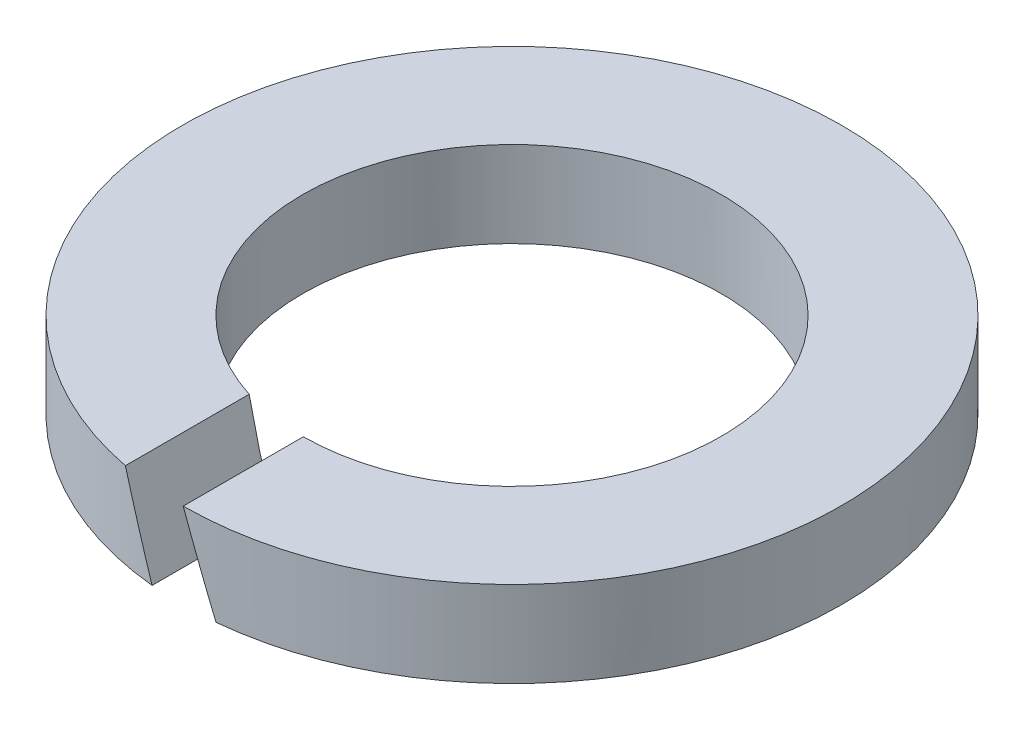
ISO-10303-21;
HEADER;
FILE_DESCRIPTION(('STEP AP214'),'2;1');
FILE_NAME('part.step','',(''),(''),'','','');
FILE_SCHEMA(('AUTOMOTIVE_DESIGN { 1 0 10303 214 1 1 1 1 }'));
ENDSEC;
DATA;
#1=APPLICATION_CONTEXT('core data for automotive mechanical design processes');
#2=APPLICATION_PROTOCOL_DEFINITION('international standard','automotive_design',2000,#1);
#3=PRODUCT_CONTEXT('',#1,'mechanical');
#4=PRODUCT('Part','Part','',(#3));
#5=PRODUCT_RELATED_PRODUCT_CATEGORY('part','',(#4));
#6=PRODUCT_DEFINITION_FORMATION('','',#4);
#7=PRODUCT_DEFINITION_CONTEXT('part definition',#1,'design');
#8=PRODUCT_DEFINITION('design','',#6,#7);
#9=PRODUCT_DEFINITION_SHAPE('','',#8);
#10=(LENGTH_UNIT() NAMED_UNIT(*) SI_UNIT(.MILLI.,.METRE.));
#11=(NAMED_UNIT(*) PLANE_ANGLE_UNIT() SI_UNIT($,.RADIAN.));
#12=(NAMED_UNIT(*) SI_UNIT($,.STERADIAN.) SOLID_ANGLE_UNIT());
#13=UNCERTAINTY_MEASURE_WITH_UNIT(LENGTH_MEASURE(1.E-05),#10,'distance_accuracy_value','');
#14=(GEOMETRIC_REPRESENTATION_CONTEXT(3) GLOBAL_UNCERTAINTY_ASSIGNED_CONTEXT((#13)) GLOBAL_UNIT_ASSIGNED_CONTEXT((#10,
#11,#12)) REPRESENTATION_CONTEXT('',''));
#15=CARTESIAN_POINT('',(0.,0.,0.));
#16=DIRECTION('',(0.,0.,1.));
#17=DIRECTION('',(1.,0.,0.));
#18=AXIS2_PLACEMENT_3D('',#15,#16,#17);
#19=CARTESIAN_POINT('',(0.,15.7596723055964,0.));
#20=DIRECTION('',(0.,1.,0.));
#21=DIRECTION('',(0.,0.,1.));
#22=AXIS2_PLACEMENT_3D('',#19,#20,#21);
#23=CYLINDRICAL_SURFACE('',#22,6.1);
#24=CARTESIAN_POINT('',(0.,0.,0.));
#25=DIRECTION('',(0.,1.,0.));
#26=DIRECTION('',(0.,0.,1.));
#27=AXIS2_PLACEMENT_3D('',#24,#25,#26);
#28=CIRCLE('',#27,6.1);
#29=CARTESIAN_POINT('',(0.931155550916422,0.,6.02851137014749));
#30=VERTEX_POINT('',#29);
#31=CARTESIAN_POINT('',(-0.931155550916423,0.,6.02851137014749));
#32=VERTEX_POINT('',#31);
#33=EDGE_CURVE('E89',#30,#32,#28,.T.);
#34=ORIENTED_EDGE('',*,*,#33,.F.);
#35=CARTESIAN_POINT('',(0.,2.55832885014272,0.));
#36=DIRECTION('',(-0.939692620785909,-0.342020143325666,0.));
#37=DIRECTION('',(-0.342020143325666,0.939692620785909,0.));
#38=AXIS2_PLACEMENT_3D('',#35,#36,#37);
#39=ELLIPSE('',#38,17.8352068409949,6.1);
#40=CARTESIAN_POINT('',(0.0212299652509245,2.5,6.09996305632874));
#41=VERTEX_POINT('',#40);
#42=EDGE_CURVE('E54',#41,#30,#39,.F.);
#43=ORIENTED_EDGE('',*,*,#42,.F.);
#44=CARTESIAN_POINT('',(0.,2.5,0.));
#45=DIRECTION('',(0.,1.,0.));
#46=DIRECTION('',(0.,0.,1.));
#47=AXIS2_PLACEMENT_3D('',#44,#45,#46);
#48=CIRCLE('',#47,6.1);
#49=CARTESIAN_POINT('',(-1.84108113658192,2.5,5.8155326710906));
#50=VERTEX_POINT('',#49);
#51=EDGE_CURVE('E11',#41,#50,#48,.T.);
#52=ORIENTED_EDGE('',*,*,#51,.T.);
#53=CARTESIAN_POINT('',(0.,-2.55832885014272,0.));
#54=DIRECTION('',(0.939692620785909,0.342020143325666,0.));
#55=DIRECTION('',(-0.342020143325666,0.939692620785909,0.));
#56=AXIS2_PLACEMENT_3D('',#53,#54,#55);
#57=ELLIPSE('',#56,17.835206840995,6.1);
#58=EDGE_CURVE('E86',#32,#50,#57,.F.);
#59=ORIENTED_EDGE('',*,*,#58,.F.);
#60=EDGE_LOOP('',(#34,#43,#52,#59));
#61=FACE_BOUND('',#60,.T.);
#62=ADVANCED_FACE('F32',(#61),#23,.F.);
#63=CARTESIAN_POINT('',(-6.1,2.5,0.));
#64=DIRECTION('',(0.,1.,0.));
#65=DIRECTION('',(0.,0.,1.));
#66=AXIS2_PLACEMENT_3D('',#63,#64,#65);
#67=PLANE('',#66);
#68=ORIENTED_EDGE('',*,*,#51,.F.);
#69=DIRECTION('',(0.,0.,-1.));
#70=VECTOR('',#69,1.);
#71=CARTESIAN_POINT('',(0.0212299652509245,2.5,9.601));
#72=LINE('',#71,#70);
#73=CARTESIAN_POINT('',(0.0212299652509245,2.5,9.59997652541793));
#74=VERTEX_POINT('',#73);
#75=EDGE_CURVE('E91',#74,#41,#72,.T.);
#76=ORIENTED_EDGE('',*,*,#75,.F.);
#77=CARTESIAN_POINT('',(0.,2.5,0.));
#78=DIRECTION('',(0.,1.,0.));
#79=DIRECTION('',(0.,0.,1.));
#80=AXIS2_PLACEMENT_3D('',#77,#78,#79);
#81=CIRCLE('',#80,9.6);
#82=CARTESIAN_POINT('',(-1.84108113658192,2.5,9.42180557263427));
#83=VERTEX_POINT('',#82);
#84=EDGE_CURVE('E39',#74,#83,#81,.T.);
#85=ORIENTED_EDGE('',*,*,#84,.T.);
#86=DIRECTION('',(0.,0.,-1.));
#87=VECTOR('',#86,1.);
#88=CARTESIAN_POINT('',(-1.84108113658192,2.5,9.601));
#89=LINE('',#88,#87);
#90=EDGE_CURVE('E95',#83,#50,#89,.T.);
#91=ORIENTED_EDGE('',*,*,#90,.T.);
#92=EDGE_LOOP('',(#68,#76,#85,#91));
#93=FACE_BOUND('',#92,.T.);
#94=ADVANCED_FACE('F106',(#93),#67,.T.);
#95=CARTESIAN_POINT('',(0.,15.7596723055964,0.));
#96=DIRECTION('',(0.,1.,0.));
#97=DIRECTION('',(0.,0.,1.));
#98=AXIS2_PLACEMENT_3D('',#95,#96,#97);
#99=CYLINDRICAL_SURFACE('',#98,9.6);
#100=ORIENTED_EDGE('',*,*,#84,.F.);
#101=CARTESIAN_POINT('',(0.,2.55832885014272,0.));
#102=DIRECTION('',(-0.939692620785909,-0.342020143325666,0.));
#103=DIRECTION('',(-0.342020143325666,0.939692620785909,0.));
#104=AXIS2_PLACEMENT_3D('',#101,#102,#103);
#105=ELLIPSE('',#104,28.0685222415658,9.6);
#106=CARTESIAN_POINT('',(0.931155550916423,0.,9.55473439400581));
#107=VERTEX_POINT('',#106);
#108=EDGE_CURVE('E72',#107,#74,#105,.T.);
#109=ORIENTED_EDGE('',*,*,#108,.F.);
#110=CARTESIAN_POINT('',(0.,0.,0.));
#111=DIRECTION('',(0.,1.,0.));
#112=DIRECTION('',(0.,0.,1.));
#113=AXIS2_PLACEMENT_3D('',#110,#111,#112);
#114=CIRCLE('',#113,9.6);
#115=CARTESIAN_POINT('',(-0.931155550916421,0.,9.5547343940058));
#116=VERTEX_POINT('',#115);
#117=EDGE_CURVE('E84',#107,#116,#114,.T.);
#118=ORIENTED_EDGE('',*,*,#117,.T.);
#119=CARTESIAN_POINT('',(0.,-2.55832885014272,0.));
#120=DIRECTION('',(0.939692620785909,0.342020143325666,0.));
#121=DIRECTION('',(-0.342020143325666,0.939692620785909,0.));
#122=AXIS2_PLACEMENT_3D('',#119,#120,#121);
#123=ELLIPSE('',#122,28.0685222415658,9.6);
#124=EDGE_CURVE('E46',#83,#116,#123,.T.);
#125=ORIENTED_EDGE('',*,*,#124,.F.);
#126=EDGE_LOOP('',(#100,#109,#118,#125));
#127=FACE_BOUND('',#126,.T.);
#128=ADVANCED_FACE('F83',(#127),#99,.T.);
#129=CARTESIAN_POINT('',(-6.1,0.,0.));
#130=DIRECTION('',(0.,-1.,0.));
#131=DIRECTION('',(0.,0.,-1.));
#132=AXIS2_PLACEMENT_3D('',#129,#130,#131);
#133=PLANE('',#132);
#134=ORIENTED_EDGE('',*,*,#117,.F.);
#135=DIRECTION('',(0.,0.,-1.));
#136=VECTOR('',#135,1.);
#137=CARTESIAN_POINT('',(0.931155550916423,0.,9.601));
#138=LINE('',#137,#136);
#139=EDGE_CURVE('E69',#107,#30,#138,.T.);
#140=ORIENTED_EDGE('',*,*,#139,.T.);
#141=ORIENTED_EDGE('',*,*,#33,.T.);
#142=DIRECTION('',(0.,0.,-1.));
#143=VECTOR('',#142,1.);
#144=CARTESIAN_POINT('',(-0.931155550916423,0.,9.601));
#145=LINE('',#144,#143);
#146=EDGE_CURVE('E78',#116,#32,#145,.T.);
#147=ORIENTED_EDGE('',*,*,#146,.F.);
#148=EDGE_LOOP('',(#134,#140,#141,#147));
#149=FACE_BOUND('',#148,.T.);
#150=ADVANCED_FACE('F88',(#149),#133,.T.);
#151=CARTESIAN_POINT('',(-1.84108113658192,2.5,9.601));
#152=DIRECTION('',(0.939692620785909,0.342020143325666,0.));
#153=DIRECTION('',(-0.342020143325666,0.939692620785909,0.));
#154=AXIS2_PLACEMENT_3D('',#151,#152,#153);
#155=PLANE('',#154);
#156=ORIENTED_EDGE('',*,*,#58,.T.);
#157=ORIENTED_EDGE('',*,*,#90,.F.);
#158=ORIENTED_EDGE('',*,*,#124,.T.);
#159=ORIENTED_EDGE('',*,*,#146,.T.);
#160=EDGE_LOOP('',(#156,#157,#158,#159));
#161=FACE_BOUND('',#160,.T.);
#162=ADVANCED_FACE('F102',(#161),#155,.T.);
#163=CARTESIAN_POINT('',(0.0212299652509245,2.5,9.601));
#164=DIRECTION('',(-0.939692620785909,-0.342020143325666,0.));
#165=DIRECTION('',(0.342020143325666,-0.939692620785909,0.));
#166=AXIS2_PLACEMENT_3D('',#163,#164,#165);
#167=PLANE('',#166);
#168=ORIENTED_EDGE('',*,*,#42,.T.);
#169=ORIENTED_EDGE('',*,*,#139,.F.);
#170=ORIENTED_EDGE('',*,*,#108,.T.);
#171=ORIENTED_EDGE('',*,*,#75,.T.);
#172=EDGE_LOOP('',(#168,#169,#170,#171));
#173=FACE_BOUND('',#172,.T.);
#174=ADVANCED_FACE('F71',(#173),#167,.T.);
#175=CLOSED_SHELL('',(#62,#94,#128,#150,#162,#174));
#176=MANIFOLD_SOLID_BREP('B2',#175);
#177=ADVANCED_BREP_SHAPE_REPRESENTATION('',(#18,#176),#14);
#178=SHAPE_DEFINITION_REPRESENTATION(#9,#177);
ENDSEC;
END-ISO-10303-21;
